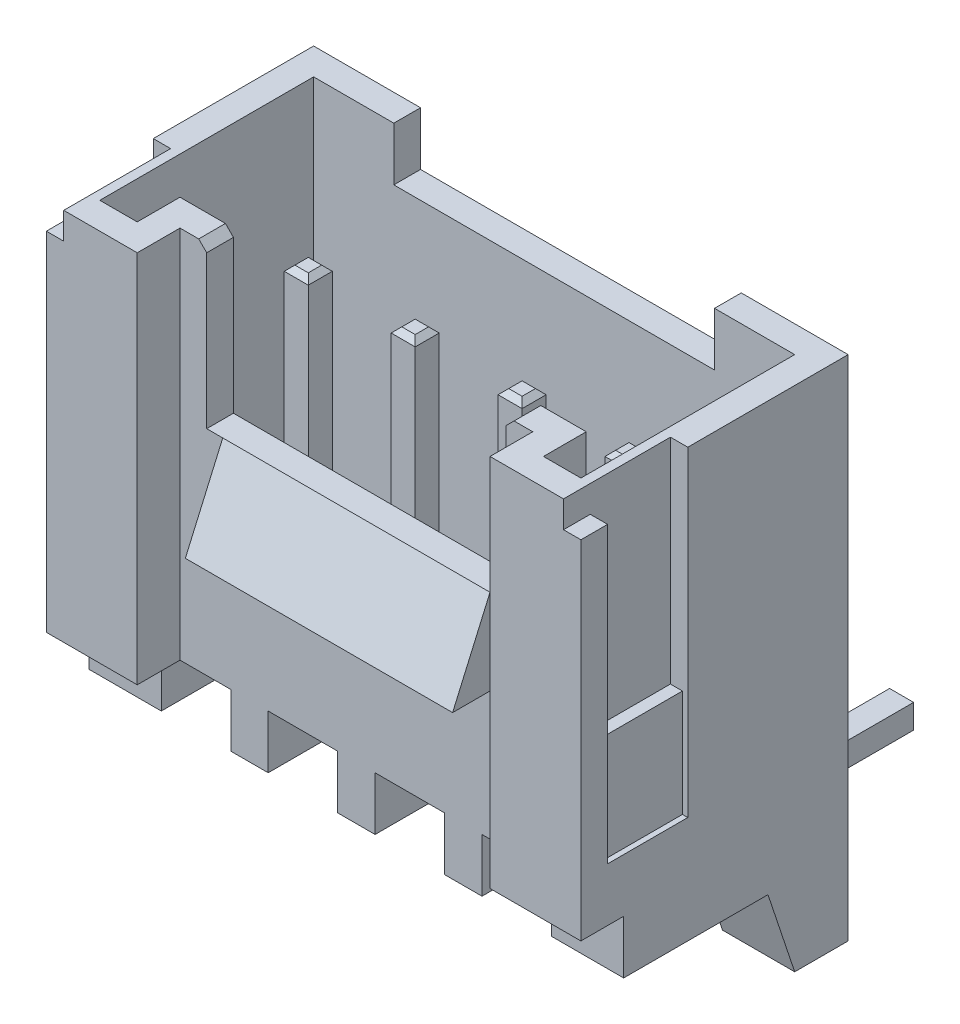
from build123d import *

# Parameters (mm, degrees)
ESQUISSE1_W                = 10
ESQUISSE1_H                = 5
BOSS_EXTRU_1_DEPTH         = 8
ESQUISSE7_W                = 0.8
ESQUISSE7_H                = 1
ENL_V_MAT_EXTRU_5_DEPTH    = 14.747727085
ENL_V_MAT_EXTRU_6_DEPTH    = 0.65
R_P_TITION_LIN_AIRE3_COUNT = 4
R_P_TITION_LIN_AIRE3_PITCH = 2
ESQUISSE2_W                = 6.6
ESQUISSE2_H                = 1.6
ENL_V_MAT_EXTRU_1_DEPTH    = 11.677078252
ENL_V_MAT_EXTRU_2_DEPTH    = 6.5
ESQUISSE5_W                = 6
ESQUISSE5_H                = 1
ENL_V_MAT_EXTRU_3_DEPTH    = 1
ESQUISSE6_W                = 5.6
ESQUISSE6_H                = 1
ENL_V_MAT_EXTRU_4_DEPTH    = 3
BOSS_EXTRU_2_DEPTH         = 2.5
CHANFREIN1_SIZE            = 0.15
EXTRU_MINCE2_DEPTH         = 0.225
R_P_TITION_LIN_AIRE4_COUNT = 4
R_P_TITION_LIN_AIRE4_PITCH = 2
BOSS_EXTRU_4_DEPTH         = 1.35
CHANFREIN2_SIZE            = 0.1
ESQUISSE19_W               = 1.5
ESQUISSE19_H               = 6.440145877
ENL_V_MAT_EXTRU_7_DEPTH    = 0.1
ENL_V_MAT_EXTRU_8_DEPTH    = 0.225
CHANFREIN3_SIZE            = 0.1
CHANFREIN4_SIZE            = 0.1
CHANFREIN5_SIZE            = 0.1


with BuildPart() as part:
    # Esquisse1 → Boss.-Extru.1 (new body)
    with BuildSketch(Plane(origin=(0, 0, 0), x_dir=(1, 0, 0), z_dir=(0, 1, 0))):
        with Locations((0, 2.5)):
            Rectangle(ESQUISSE1_W, ESQUISSE1_H)
    extrude(amount=BOSS_EXTRU_1_DEPTH)

    # Esquisse7 → Enl_v. mat.-Extru.5 (cut, through all)
    with BuildSketch(Plane(origin=(5, 0, 0), x_dir=(0, 0, -1), z_dir=(1, 0, 0))):
        with Locations((0.4, 0.5)):
            Rectangle(ESQUISSE7_W, ESQUISSE7_H)
    extrude(amount=-ENL_V_MAT_EXTRU_5_DEPTH, mode=Mode.SUBTRACT)

    # Esquisse8 → Enl_v. mat.-Extru.6 (cut, symmetric)
    with BuildSketch(Plane(origin=(3, 0, 0), x_dir=(0, 0, -1), z_dir=(1, 0, 0))):
        Polygon((0.8, 1), (1.1, 1), (1.9, 0.2), (3.9, 0.2), (4.7, 1), (5, 1), (5, 0), (0.8, 0), align=None)
    enl_v_mat_extru_6 = extrude(amount=ENL_V_MAT_EXTRU_6_DEPTH, both=True, mode=Mode.SUBTRACT)

    # R_p_tition lin_aire3: Enl_v. mat.-Extru.6 ×4
    with Locations(*[(-i * R_P_TITION_LIN_AIRE3_PITCH, 0, 0) for i in range(1, R_P_TITION_LIN_AIRE3_COUNT)]):
        add(enl_v_mat_extru_6, mode=Mode.SUBTRACT)

    # Esquisse2 → Enl_v. mat.-Extru.1 (cut, through all)
    with BuildSketch(Plane(origin=(0, 8, 0), x_dir=(1, 0, 0), z_dir=(0, 1, 0))):
        Rectangle(ESQUISSE2_W, ESQUISSE2_H)
    extrude(amount=-ENL_V_MAT_EXTRU_1_DEPTH, mode=Mode.SUBTRACT)

    # Esquisse4 → Enl_v. mat.-Extru.2 (cut)
    with BuildSketch(Plane(origin=(0, 8, 0), x_dir=(1, 0, 0), z_dir=(0, 1, 0))):
        Polygon((-3.8, 1.3), (3.8, 1.3), (3.8, 0.5), (4.5, 0.5), (4.5, 4.5), (-4.5, 4.5), (-4.5, 0.5), (-3.8, 0.5), align=None)
    extrude(amount=-ENL_V_MAT_EXTRU_2_DEPTH, mode=Mode.SUBTRACT)

    # Esquisse5 → Enl_v. mat.-Extru.3 (cut)
    with BuildSketch(Plane(origin=(0, 8, 0), x_dir=(1, 0, 0), z_dir=(0, 1, 0))):
        with Locations((0, 4.5)):
            Rectangle(ESQUISSE5_W, ESQUISSE5_H)
    extrude(amount=-ENL_V_MAT_EXTRU_3_DEPTH, mode=Mode.SUBTRACT)

    # Esquisse6 → Enl_v. mat.-Extru.4 (cut)
    with BuildSketch(Plane(origin=(0, 8, 0), x_dir=(1, 0, 0), z_dir=(0, 1, 0))):
        with Locations((0, 0.8)):
            Rectangle(ESQUISSE6_W, ESQUISSE6_H)
    extrude(amount=-ENL_V_MAT_EXTRU_4_DEPTH, mode=Mode.SUBTRACT)

    # Esquisse11 → Boss.-Extru.2 (add, symmetric)
    with BuildSketch(Plane(origin=(0, 0, 0), x_dir=(0, 0, -1), z_dir=(1, 0, 0))):
        Polygon((0.8, 5), (0.1, 3.4), (0.8, 3.4), align=None)
    extrude(amount=BOSS_EXTRU_2_DEPTH, both=True)

    # Chanfrein1
    chanfrein1_edges = [part.edges().sort_by_distance(p)[0] for p in [
        (2.8, 8, -1.05),
        (-2.8, 8, -1.05),
    ]]
    chamfer(chanfrein1_edges, length=CHANFREIN1_SIZE)

    # Esquisse18 → Boss.-Extru.4 (add)
    with BuildSketch(Plane.ZY.offset(5)):
        Polygon((-5, 0), (-5, -1.5), (-4, -1.5), (-3.5, 0), align=None)
    boss_extru_4 = extrude(amount=-BOSS_EXTRU_4_DEPTH)

    # Esquisse19 → Enl_v. mat.-Extru.7 (cut)
    with BuildSketch(Plane.ZY.offset(5)):
        with Locations((-1.25, 5.220072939)):
            Rectangle(ESQUISSE19_W, ESQUISSE19_H)
    enl_v_mat_extru_7 = extrude(amount=-ENL_V_MAT_EXTRU_7_DEPTH, mode=Mode.SUBTRACT)

    # Esquisse20 → Enl_v. mat.-Extru.8 (cut, symmetric)
    with BuildSketch(Plane.ZY.offset(4.9)):
        Polygon((-2, 4), (-0.5, 4), (-0.5, 7.5), (0.56066855, 7.5), (0.56066855, 8.388803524), (-2, 8.388803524), align=None)
    enl_v_mat_extru_8 = extrude(amount=ENL_V_MAT_EXTRU_8_DEPTH, both=True, mode=Mode.SUBTRACT)

    # Sym_trie5: Enl_v. mat.-Extru.7 across plane
    add(enl_v_mat_extru_7.mirror(Plane(origin=(0, 0, 0), x_dir=(0, 0, 1), z_dir=(1, 0, 0))), mode=Mode.SUBTRACT)

    # Sym_trie6: Enl_v. mat.-Extru.8 across plane
    add(enl_v_mat_extru_8.mirror(Plane(origin=(0, 0, 0), x_dir=(0, 0, 1), z_dir=(1, 0, 0))), mode=Mode.SUBTRACT)

    # Sym_trie8: Boss.-Extru.4 across plane
    add(boss_extru_4.mirror(Plane(origin=(0, 0, 0), x_dir=(0, 0, 1), z_dir=(1, 0, 0))))


with BuildPart() as body_2:
    # Esquisse16 → Extru.-Mince2 (new, symmetric)
    with BuildSketch(Plane.ZY.offset(-3)):
        with BuildLine():
            Line((-3.125, 6.5), (-3.125, -0.021727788))
            Line((-3.125, -0.021727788), (-8, -0.021727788))
            Line((-8, -0.021727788), (-8, -0.471727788))
            Line((-8, -0.471727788), (-3.05543443, -0.471727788))
            ThreePointArc((-3.05543443, -0.471727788), (-2.783090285, -0.319708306), (-2.675, -0.02713738))
            Line((-2.675, -0.02713738), (-2.675, 6.5))
            Line((-2.675, 6.5), (-3.125, 6.5))
        make_face()
    extrude(amount=EXTRU_MINCE2_DEPTH, both=True)


with BuildPart() as r_p_tition_lin_aire4_1:
    # R_p_tition lin_aire4: pattern copy
    add(body_2.part.moved(Location(Vector(-1, 0, 0) * (1 * R_P_TITION_LIN_AIRE4_PITCH))))

    # Chanfrein5
    chanfrein5_edges = [r_p_tition_lin_aire4_1.edges().sort_by_distance(p)[0] for p in [
        (1, 6.5, -3.125),
        (1, 6.5, -2.675),
        (0.775, 6.5, -2.9),
        (1.225, 6.5, -2.9),
    ]]
    chamfer(chanfrein5_edges, length=CHANFREIN5_SIZE)


with BuildPart() as r_p_tition_lin_aire4_2:
    # R_p_tition lin_aire4: pattern copy
    add(body_2.part.moved(Location(Vector(-1, 0, 0) * (2 * R_P_TITION_LIN_AIRE4_PITCH))))

    # Chanfrein4
    chanfrein4_edges = [r_p_tition_lin_aire4_2.edges().sort_by_distance(p)[0] for p in [
        (-1, 6.5, -3.125),
        (-1, 6.5, -2.675),
        (-1.225, 6.5, -2.9),
        (-0.775, 6.5, -2.9),
    ]]
    chamfer(chanfrein4_edges, length=CHANFREIN4_SIZE)


with BuildPart() as r_p_tition_lin_aire4_3:
    # R_p_tition lin_aire4: pattern copy
    add(body_2.part.moved(Location(Vector(-1, 0, 0) * (3 * R_P_TITION_LIN_AIRE4_PITCH))))

    # Chanfrein3
    chanfrein3_edges = [r_p_tition_lin_aire4_3.edges().sort_by_distance(p)[0] for p in [
        (-3, 6.5, -3.125),
        (-3, 6.5, -2.675),
        (-3.225, 6.5, -2.9),
        (-2.775, 6.5, -2.9),
    ]]
    chamfer(chanfrein3_edges, length=CHANFREIN3_SIZE)


with BuildPart() as body_2_1:
    add(body_2.part)

    # Chanfrein2
    chanfrein2_edges = [body_2_1.edges().sort_by_distance(p)[0] for p in [
        (3, 6.5, -3.125),
        (3, 6.5, -2.675),
        (2.775, 6.5, -2.9),
        (3.225, 6.5, -2.9),
    ]]
    chamfer(chanfrein2_edges, length=CHANFREIN2_SIZE)


solid = Compound([part.part, r_p_tition_lin_aire4_1.part, r_p_tition_lin_aire4_2.part, r_p_tition_lin_aire4_3.part, body_2_1.part])
